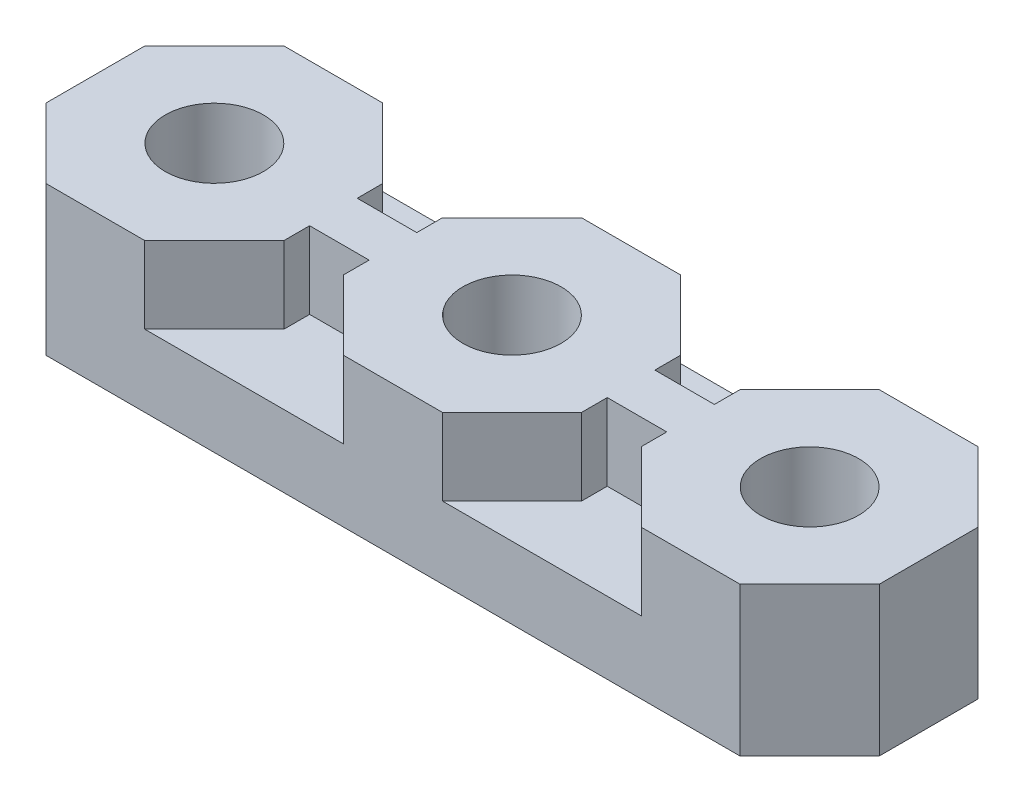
ISO-10303-21;
HEADER;
FILE_DESCRIPTION(('STEP AP214'),'2;1');
FILE_NAME('part.step','',(''),(''),'','','');
FILE_SCHEMA(('AUTOMOTIVE_DESIGN { 1 0 10303 214 1 1 1 1 }'));
ENDSEC;
DATA;
#1=APPLICATION_CONTEXT('core data for automotive mechanical design processes');
#2=APPLICATION_PROTOCOL_DEFINITION('international standard','automotive_design',2000,#1);
#3=PRODUCT_CONTEXT('',#1,'mechanical');
#4=PRODUCT('Part','Part','',(#3));
#5=PRODUCT_RELATED_PRODUCT_CATEGORY('part','',(#4));
#6=PRODUCT_DEFINITION_FORMATION('','',#4);
#7=PRODUCT_DEFINITION_CONTEXT('part definition',#1,'design');
#8=PRODUCT_DEFINITION('design','',#6,#7);
#9=PRODUCT_DEFINITION_SHAPE('','',#8);
#10=(LENGTH_UNIT() NAMED_UNIT(*) SI_UNIT(.MILLI.,.METRE.));
#11=(NAMED_UNIT(*) PLANE_ANGLE_UNIT() SI_UNIT($,.RADIAN.));
#12=(NAMED_UNIT(*) SI_UNIT($,.STERADIAN.) SOLID_ANGLE_UNIT());
#13=UNCERTAINTY_MEASURE_WITH_UNIT(LENGTH_MEASURE(1.E-05),#10,'distance_accuracy_value','');
#14=(GEOMETRIC_REPRESENTATION_CONTEXT(3) GLOBAL_UNCERTAINTY_ASSIGNED_CONTEXT((#13)) GLOBAL_UNIT_ASSIGNED_CONTEXT((#10,
#11,#12)) REPRESENTATION_CONTEXT('',''));
#15=CARTESIAN_POINT('',(0.,0.,0.));
#16=DIRECTION('',(0.,0.,1.));
#17=DIRECTION('',(1.,0.,0.));
#18=AXIS2_PLACEMENT_3D('',#15,#16,#17);
#19=CARTESIAN_POINT('',(0.,0.,0.));
#20=DIRECTION('',(0.,-1.,0.));
#21=DIRECTION('',(0.,0.,-1.));
#22=AXIS2_PLACEMENT_3D('',#19,#20,#21);
#23=PLANE('',#22);
#24=DIRECTION('',(0.,0.,1.));
#25=VECTOR('',#24,1.);
#26=CARTESIAN_POINT('',(-2.23593242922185,0.,0.));
#27=LINE('',#26,#25);
#28=CARTESIAN_POINT('',(-2.23593242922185,0.,-3.556));
#29=VERTEX_POINT('',#28);
#30=CARTESIAN_POINT('',(-2.23593242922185,0.,3.556));
#31=VERTEX_POINT('',#30);
#32=EDGE_CURVE('E58',#29,#31,#27,.T.);
#33=ORIENTED_EDGE('',*,*,#32,.F.);
#34=DIRECTION('',(1.,0.,0.));
#35=VECTOR('',#34,1.);
#36=CARTESIAN_POINT('',(0.,0.,-3.556));
#37=LINE('',#36,#35);
#38=CARTESIAN_POINT('',(-10.3639324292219,0.,-3.556));
#39=VERTEX_POINT('',#38);
#40=EDGE_CURVE('E334',#39,#29,#37,.T.);
#41=ORIENTED_EDGE('',*,*,#40,.F.);
#42=DIRECTION('',(0.,0.,1.));
#43=VECTOR('',#42,1.);
#44=CARTESIAN_POINT('',(-10.3639324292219,0.,0.));
#45=LINE('',#44,#43);
#46=CARTESIAN_POINT('',(-10.3639324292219,0.,3.556));
#47=VERTEX_POINT('',#46);
#48=EDGE_CURVE('E346',#39,#47,#45,.T.);
#49=ORIENTED_EDGE('',*,*,#48,.T.);
#50=DIRECTION('',(1.,0.,0.));
#51=VECTOR('',#50,1.);
#52=CARTESIAN_POINT('',(0.,0.,3.556));
#53=LINE('',#52,#51);
#54=EDGE_CURVE('E343',#47,#31,#53,.T.);
#55=ORIENTED_EDGE('',*,*,#54,.T.);
#56=EDGE_LOOP('',(#33,#41,#49,#55));
#57=FACE_BOUND('',#56,.T.);
#58=CARTESIAN_POINT('',(0.,0.,0.));
#59=DIRECTION('',(0.,1.,0.));
#60=DIRECTION('',(0.,0.,1.));
#61=AXIS2_PLACEMENT_3D('',#58,#59,#60);
#62=CIRCLE('',#61,2.0955);
#63=CARTESIAN_POINT('',(0.,0.,2.0955));
#64=VERTEX_POINT('',#63);
#65=EDGE_CURVE('E576',#64,#64,#62,.T.);
#66=ORIENTED_EDGE('',*,*,#65,.T.);
#67=EDGE_LOOP('',(#66));
#68=FACE_BOUND('',#67,.T.);
#69=CARTESIAN_POINT('',(12.7,0.,0.));
#70=DIRECTION('',(0.,1.,0.));
#71=DIRECTION('',(0.,0.,1.));
#72=AXIS2_PLACEMENT_3D('',#69,#70,#71);
#73=CIRCLE('',#72,2.0955);
#74=CARTESIAN_POINT('',(12.7,0.,2.0955));
#75=VERTEX_POINT('',#74);
#76=EDGE_CURVE('E583',#75,#75,#73,.T.);
#77=ORIENTED_EDGE('',*,*,#76,.T.);
#78=EDGE_LOOP('',(#77));
#79=FACE_BOUND('',#78,.T.);
#80=CARTESIAN_POINT('',(-12.7,0.,0.));
#81=DIRECTION('',(0.,1.,0.));
#82=DIRECTION('',(0.,0.,1.));
#83=AXIS2_PLACEMENT_3D('',#80,#81,#82);
#84=CIRCLE('',#83,2.0955);
#85=CARTESIAN_POINT('',(-12.7,0.,2.0955));
#86=VERTEX_POINT('',#85);
#87=EDGE_CURVE('E588',#86,#86,#84,.T.);
#88=ORIENTED_EDGE('',*,*,#87,.T.);
#89=EDGE_LOOP('',(#88));
#90=FACE_BOUND('',#89,.T.);
#91=DIRECTION('',(1.,0.,0.));
#92=VECTOR('',#91,1.);
#93=CARTESIAN_POINT('',(17.78,0.,5.08));
#94=LINE('',#93,#92);
#95=CARTESIAN_POINT('',(-14.8042048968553,0.,5.08000000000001));
#96=VERTEX_POINT('',#95);
#97=CARTESIAN_POINT('',(14.8042048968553,0.,5.08));
#98=VERTEX_POINT('',#97);
#99=EDGE_CURVE('E606',#96,#98,#94,.T.);
#100=ORIENTED_EDGE('',*,*,#99,.F.);
#101=DIRECTION('',(0.707106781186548,0.,0.707106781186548));
#102=VECTOR('',#101,1.);
#103=CARTESIAN_POINT('',(-9.94210244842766,0.,9.94210244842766));
#104=LINE('',#103,#102);
#105=CARTESIAN_POINT('',(-17.78,0.,2.10420489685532));
#106=VERTEX_POINT('',#105);
#107=EDGE_CURVE('E359',#106,#96,#104,.T.);
#108=ORIENTED_EDGE('',*,*,#107,.F.);
#109=DIRECTION('',(0.,0.,1.));
#110=VECTOR('',#109,1.);
#111=CARTESIAN_POINT('',(-17.78,0.,-5.07999999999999));
#112=LINE('',#111,#110);
#113=CARTESIAN_POINT('',(-17.78,0.,-2.10420489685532));
#114=VERTEX_POINT('',#113);
#115=EDGE_CURVE('E591',#114,#106,#112,.T.);
#116=ORIENTED_EDGE('',*,*,#115,.F.);
#117=DIRECTION('',(-0.707106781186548,0.,0.707106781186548));
#118=VECTOR('',#117,1.);
#119=CARTESIAN_POINT('',(-9.94210244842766,0.,-9.94210244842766));
#120=LINE('',#119,#118);
#121=CARTESIAN_POINT('',(-14.8042048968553,0.,-5.07999999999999));
#122=VERTEX_POINT('',#121);
#123=EDGE_CURVE('E389',#122,#114,#120,.T.);
#124=ORIENTED_EDGE('',*,*,#123,.F.);
#125=DIRECTION('',(-1.,0.,0.));
#126=VECTOR('',#125,1.);
#127=CARTESIAN_POINT('',(17.78,0.,-5.08));
#128=LINE('',#127,#126);
#129=CARTESIAN_POINT('',(14.8042048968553,0.,-5.08));
#130=VERTEX_POINT('',#129);
#131=EDGE_CURVE('E36',#130,#122,#128,.T.);
#132=ORIENTED_EDGE('',*,*,#131,.F.);
#133=DIRECTION('',(0.707106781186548,0.,0.707106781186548));
#134=VECTOR('',#133,1.);
#135=CARTESIAN_POINT('',(9.94210244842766,0.,-9.94210244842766));
#136=LINE('',#135,#134);
#137=CARTESIAN_POINT('',(17.78,0.,-2.10420489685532));
#138=VERTEX_POINT('',#137);
#139=EDGE_CURVE('E381',#130,#138,#136,.T.);
#140=ORIENTED_EDGE('',*,*,#139,.T.);
#141=DIRECTION('',(0.,0.,-1.));
#142=VECTOR('',#141,1.);
#143=CARTESIAN_POINT('',(17.78,0.,-5.08));
#144=LINE('',#143,#142);
#145=CARTESIAN_POINT('',(17.78,0.,2.10420489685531));
#146=VERTEX_POINT('',#145);
#147=EDGE_CURVE('E608',#146,#138,#144,.T.);
#148=ORIENTED_EDGE('',*,*,#147,.F.);
#149=DIRECTION('',(-0.707106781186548,0.,0.707106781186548));
#150=VECTOR('',#149,1.);
#151=CARTESIAN_POINT('',(9.94210244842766,0.,9.94210244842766));
#152=LINE('',#151,#150);
#153=EDGE_CURVE('E371',#146,#98,#152,.T.);
#154=ORIENTED_EDGE('',*,*,#153,.T.);
#155=EDGE_LOOP('',(#100,#108,#116,#124,#132,#140,#148,#154));
#156=FACE_BOUND('',#155,.T.);
#157=DIRECTION('',(-1.,0.,0.));
#158=VECTOR('',#157,1.);
#159=CARTESIAN_POINT('',(0.,0.,-3.556));
#160=LINE('',#159,#158);
#161=CARTESIAN_POINT('',(10.3639324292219,0.,-3.556));
#162=VERTEX_POINT('',#161);
#163=CARTESIAN_POINT('',(2.23593242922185,0.,-3.556));
#164=VERTEX_POINT('',#163);
#165=EDGE_CURVE('E321',#162,#164,#160,.T.);
#166=ORIENTED_EDGE('',*,*,#165,.T.);
#167=DIRECTION('',(0.,0.,1.));
#168=VECTOR('',#167,1.);
#169=CARTESIAN_POINT('',(2.23593242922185,0.,0.));
#170=LINE('',#169,#168);
#171=CARTESIAN_POINT('',(2.23593242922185,0.,3.556));
#172=VERTEX_POINT('',#171);
#173=EDGE_CURVE('E50',#164,#172,#170,.T.);
#174=ORIENTED_EDGE('',*,*,#173,.T.);
#175=DIRECTION('',(-1.,0.,0.));
#176=VECTOR('',#175,1.);
#177=CARTESIAN_POINT('',(0.,0.,3.556));
#178=LINE('',#177,#176);
#179=CARTESIAN_POINT('',(10.3639324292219,0.,3.556));
#180=VERTEX_POINT('',#179);
#181=EDGE_CURVE('E312',#180,#172,#178,.T.);
#182=ORIENTED_EDGE('',*,*,#181,.F.);
#183=DIRECTION('',(0.,0.,1.));
#184=VECTOR('',#183,1.);
#185=CARTESIAN_POINT('',(10.3639324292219,0.,0.));
#186=LINE('',#185,#184);
#187=EDGE_CURVE('E315',#162,#180,#186,.T.);
#188=ORIENTED_EDGE('',*,*,#187,.F.);
#189=EDGE_LOOP('',(#166,#174,#182,#188));
#190=FACE_BOUND('',#189,.T.);
#191=ADVANCED_FACE('F32',(#57,#68,#79,#90,#156,#190),#23,.T.);
#192=CARTESIAN_POINT('',(0.,6.35,0.));
#193=DIRECTION('',(0.,-1.,0.));
#194=DIRECTION('',(0.,0.,-1.));
#195=AXIS2_PLACEMENT_3D('',#192,#193,#194);
#196=PLANE('',#195);
#197=CARTESIAN_POINT('',(-12.7,6.35,0.));
#198=DIRECTION('',(0.,1.,0.));
#199=DIRECTION('',(0.,0.,1.));
#200=AXIS2_PLACEMENT_3D('',#197,#198,#199);
#201=CIRCLE('',#200,2.0955);
#202=CARTESIAN_POINT('',(-12.7,6.35,2.0955));
#203=VERTEX_POINT('',#202);
#204=EDGE_CURVE('E579',#203,#203,#201,.T.);
#205=ORIENTED_EDGE('',*,*,#204,.F.);
#206=EDGE_LOOP('',(#205));
#207=FACE_BOUND('',#206,.T.);
#208=CARTESIAN_POINT('',(12.7,6.35,0.));
#209=DIRECTION('',(0.,1.,0.));
#210=DIRECTION('',(0.,0.,1.));
#211=AXIS2_PLACEMENT_3D('',#208,#209,#210);
#212=CIRCLE('',#211,2.0955);
#213=CARTESIAN_POINT('',(12.7,6.35,2.0955));
#214=VERTEX_POINT('',#213);
#215=EDGE_CURVE('E564',#214,#214,#212,.T.);
#216=ORIENTED_EDGE('',*,*,#215,.F.);
#217=EDGE_LOOP('',(#216));
#218=FACE_BOUND('',#217,.T.);
#219=CARTESIAN_POINT('',(0.,6.35,0.));
#220=DIRECTION('',(0.,1.,0.));
#221=DIRECTION('',(0.,0.,1.));
#222=AXIS2_PLACEMENT_3D('',#219,#220,#221);
#223=CIRCLE('',#222,2.0955);
#224=CARTESIAN_POINT('',(0.,6.35,2.0955));
#225=VERTEX_POINT('',#224);
#226=EDGE_CURVE('E580',#225,#225,#223,.T.);
#227=ORIENTED_EDGE('',*,*,#226,.F.);
#228=EDGE_LOOP('',(#227));
#229=FACE_BOUND('',#228,.T.);
#230=DIRECTION('',(0.707106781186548,0.,0.707106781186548));
#231=VECTOR('',#230,1.);
#232=CARTESIAN_POINT('',(-9.94210244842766,6.35,9.94210244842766));
#233=LINE('',#232,#231);
#234=CARTESIAN_POINT('',(-17.78,6.35,2.10420489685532));
#235=VERTEX_POINT('',#234);
#236=CARTESIAN_POINT('',(-14.8042048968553,6.35,5.08000000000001));
#237=VERTEX_POINT('',#236);
#238=EDGE_CURVE('E362',#235,#237,#233,.T.);
#239=ORIENTED_EDGE('',*,*,#238,.T.);
#240=DIRECTION('',(1.,0.,0.));
#241=VECTOR('',#240,1.);
#242=CARTESIAN_POINT('',(17.78,6.35,5.08));
#243=LINE('',#242,#241);
#244=CARTESIAN_POINT('',(-10.5957951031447,6.35,5.08000000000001));
#245=VERTEX_POINT('',#244);
#246=EDGE_CURVE('E598',#237,#245,#243,.T.);
#247=ORIENTED_EDGE('',*,*,#246,.T.);
#248=DIRECTION('',(0.707106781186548,0.,-0.707106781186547));
#249=VECTOR('',#248,1.);
#250=CARTESIAN_POINT('',(-2.75789755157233,6.35,-2.75789755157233));
#251=LINE('',#250,#249);
#252=CARTESIAN_POINT('',(-7.61999999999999,6.35,2.10420489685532));
#253=VERTEX_POINT('',#252);
#254=EDGE_CURVE('E426',#245,#253,#251,.T.);
#255=ORIENTED_EDGE('',*,*,#254,.T.);
#256=DIRECTION('',(0.,0.,-1.));
#257=VECTOR('',#256,1.);
#258=CARTESIAN_POINT('',(-7.61999999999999,6.35,0.));
#259=LINE('',#258,#257);
#260=CARTESIAN_POINT('',(-7.61999999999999,6.35,1.016));
#261=VERTEX_POINT('',#260);
#262=EDGE_CURVE('E423',#253,#261,#259,.T.);
#263=ORIENTED_EDGE('',*,*,#262,.T.);
#264=DIRECTION('',(-1.,0.,0.));
#265=VECTOR('',#264,1.);
#266=CARTESIAN_POINT('',(0.,6.35,1.016));
#267=LINE('',#266,#265);
#268=CARTESIAN_POINT('',(-5.08,6.35,1.016));
#269=VERTEX_POINT('',#268);
#270=EDGE_CURVE('E419',#269,#261,#267,.T.);
#271=ORIENTED_EDGE('',*,*,#270,.F.);
#272=DIRECTION('',(0.,0.,1.));
#273=VECTOR('',#272,1.);
#274=CARTESIAN_POINT('',(-5.08,6.35,0.));
#275=LINE('',#274,#273);
#276=CARTESIAN_POINT('',(-5.08,6.35,2.10420489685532));
#277=VERTEX_POINT('',#276);
#278=EDGE_CURVE('E416',#269,#277,#275,.T.);
#279=ORIENTED_EDGE('',*,*,#278,.T.);
#280=DIRECTION('',(0.707106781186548,0.,0.707106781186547));
#281=VECTOR('',#280,1.);
#282=CARTESIAN_POINT('',(-3.59210244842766,6.35,3.59210244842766));
#283=LINE('',#282,#281);
#284=CARTESIAN_POINT('',(-2.10420489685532,6.35,5.08));
#285=VERTEX_POINT('',#284);
#286=EDGE_CURVE('E403',#277,#285,#283,.T.);
#287=ORIENTED_EDGE('',*,*,#286,.T.);
#288=CARTESIAN_POINT('',(2.10420489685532,6.35,5.08));
#289=VERTEX_POINT('',#288);
#290=EDGE_CURVE('E601',#285,#289,#243,.T.);
#291=ORIENTED_EDGE('',*,*,#290,.T.);
#292=DIRECTION('',(0.707106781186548,0.,-0.707106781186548));
#293=VECTOR('',#292,1.);
#294=CARTESIAN_POINT('',(3.59210244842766,6.35,3.59210244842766));
#295=LINE('',#294,#293);
#296=CARTESIAN_POINT('',(5.08,6.35,2.10420489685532));
#297=VERTEX_POINT('',#296);
#298=EDGE_CURVE('E472',#289,#297,#295,.T.);
#299=ORIENTED_EDGE('',*,*,#298,.T.);
#300=DIRECTION('',(0.,0.,-1.));
#301=VECTOR('',#300,1.);
#302=CARTESIAN_POINT('',(5.08,6.35,0.));
#303=LINE('',#302,#301);
#304=CARTESIAN_POINT('',(5.08,6.35,1.016));
#305=VERTEX_POINT('',#304);
#306=EDGE_CURVE('E469',#297,#305,#303,.T.);
#307=ORIENTED_EDGE('',*,*,#306,.T.);
#308=DIRECTION('',(-1.,0.,0.));
#309=VECTOR('',#308,1.);
#310=CARTESIAN_POINT('',(0.,6.35,1.016));
#311=LINE('',#310,#309);
#312=CARTESIAN_POINT('',(7.61999999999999,6.35,1.016));
#313=VERTEX_POINT('',#312);
#314=EDGE_CURVE('E465',#313,#305,#311,.T.);
#315=ORIENTED_EDGE('',*,*,#314,.F.);
#316=DIRECTION('',(0.,0.,-1.));
#317=VECTOR('',#316,1.);
#318=CARTESIAN_POINT('',(7.61999999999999,6.35,0.));
#319=LINE('',#318,#317);
#320=CARTESIAN_POINT('',(7.61999999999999,6.35,2.10420489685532));
#321=VERTEX_POINT('',#320);
#322=EDGE_CURVE('E462',#321,#313,#319,.T.);
#323=ORIENTED_EDGE('',*,*,#322,.F.);
#324=DIRECTION('',(-0.707106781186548,0.,-0.707106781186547));
#325=VECTOR('',#324,1.);
#326=CARTESIAN_POINT('',(2.75789755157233,6.35,-2.75789755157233));
#327=LINE('',#326,#325);
#328=CARTESIAN_POINT('',(10.5957951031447,6.35,5.08));
#329=VERTEX_POINT('',#328);
#330=EDGE_CURVE('E449',#329,#321,#327,.T.);
#331=ORIENTED_EDGE('',*,*,#330,.F.);
#332=CARTESIAN_POINT('',(14.8042048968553,6.35,5.08));
#333=VERTEX_POINT('',#332);
#334=EDGE_CURVE('E597',#329,#333,#243,.T.);
#335=ORIENTED_EDGE('',*,*,#334,.T.);
#336=DIRECTION('',(-0.707106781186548,0.,0.707106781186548));
#337=VECTOR('',#336,1.);
#338=CARTESIAN_POINT('',(9.94210244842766,6.35,9.94210244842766));
#339=LINE('',#338,#337);
#340=CARTESIAN_POINT('',(17.78,6.35,2.10420489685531));
#341=VERTEX_POINT('',#340);
#342=EDGE_CURVE('E375',#341,#333,#339,.T.);
#343=ORIENTED_EDGE('',*,*,#342,.F.);
#344=DIRECTION('',(0.,0.,-1.));
#345=VECTOR('',#344,1.);
#346=CARTESIAN_POINT('',(17.78,6.35,-5.08));
#347=LINE('',#346,#345);
#348=CARTESIAN_POINT('',(17.78,6.35,-2.10420489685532));
#349=VERTEX_POINT('',#348);
#350=EDGE_CURVE('E600',#341,#349,#347,.T.);
#351=ORIENTED_EDGE('',*,*,#350,.T.);
#352=DIRECTION('',(0.707106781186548,0.,0.707106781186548));
#353=VECTOR('',#352,1.);
#354=CARTESIAN_POINT('',(9.94210244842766,6.35,-9.94210244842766));
#355=LINE('',#354,#353);
#356=CARTESIAN_POINT('',(14.8042048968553,6.35,-5.08));
#357=VERTEX_POINT('',#356);
#358=EDGE_CURVE('E353',#357,#349,#355,.T.);
#359=ORIENTED_EDGE('',*,*,#358,.F.);
#360=DIRECTION('',(-1.,0.,0.));
#361=VECTOR('',#360,1.);
#362=CARTESIAN_POINT('',(17.78,6.35,-5.08));
#363=LINE('',#362,#361);
#364=CARTESIAN_POINT('',(10.5957951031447,6.35,-5.08));
#365=VERTEX_POINT('',#364);
#366=EDGE_CURVE('E11',#357,#365,#363,.T.);
#367=ORIENTED_EDGE('',*,*,#366,.T.);
#368=DIRECTION('',(0.707106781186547,0.,-0.707106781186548));
#369=VECTOR('',#368,1.);
#370=CARTESIAN_POINT('',(2.75789755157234,6.35,2.75789755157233));
#371=LINE('',#370,#369);
#372=CARTESIAN_POINT('',(7.61999999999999,6.35,-2.10420489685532));
#373=VERTEX_POINT('',#372);
#374=EDGE_CURVE('E511',#373,#365,#371,.T.);
#375=ORIENTED_EDGE('',*,*,#374,.F.);
#376=DIRECTION('',(0.,0.,-1.));
#377=VECTOR('',#376,1.);
#378=CARTESIAN_POINT('',(7.61999999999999,6.35,0.));
#379=LINE('',#378,#377);
#380=CARTESIAN_POINT('',(7.61999999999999,6.35,-1.016));
#381=VERTEX_POINT('',#380);
#382=EDGE_CURVE('E508',#381,#373,#379,.T.);
#383=ORIENTED_EDGE('',*,*,#382,.F.);
#384=DIRECTION('',(-1.,0.,0.));
#385=VECTOR('',#384,1.);
#386=CARTESIAN_POINT('',(0.,6.35,-1.016));
#387=LINE('',#386,#385);
#388=CARTESIAN_POINT('',(5.08,6.35,-1.016));
#389=VERTEX_POINT('',#388);
#390=EDGE_CURVE('E396',#381,#389,#387,.T.);
#391=ORIENTED_EDGE('',*,*,#390,.T.);
#392=DIRECTION('',(0.,0.,-1.));
#393=VECTOR('',#392,1.);
#394=CARTESIAN_POINT('',(5.08,6.35,0.));
#395=LINE('',#394,#393);
#396=CARTESIAN_POINT('',(5.08,6.35,-2.10420489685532));
#397=VERTEX_POINT('',#396);
#398=EDGE_CURVE('E492',#389,#397,#395,.T.);
#399=ORIENTED_EDGE('',*,*,#398,.T.);
#400=DIRECTION('',(-0.707106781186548,0.,-0.707106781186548));
#401=VECTOR('',#400,1.);
#402=CARTESIAN_POINT('',(3.59210244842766,6.35,-3.59210244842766));
#403=LINE('',#402,#401);
#404=CARTESIAN_POINT('',(2.10420489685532,6.35,-5.08));
#405=VERTEX_POINT('',#404);
#406=EDGE_CURVE('E514',#397,#405,#403,.T.);
#407=ORIENTED_EDGE('',*,*,#406,.T.);
#408=CARTESIAN_POINT('',(-2.10420489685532,6.35,-5.08));
#409=VERTEX_POINT('',#408);
#410=EDGE_CURVE('E41',#405,#409,#363,.T.);
#411=ORIENTED_EDGE('',*,*,#410,.T.);
#412=DIRECTION('',(-0.707106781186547,0.,0.707106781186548));
#413=VECTOR('',#412,1.);
#414=CARTESIAN_POINT('',(-3.59210244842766,6.35,-3.59210244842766));
#415=LINE('',#414,#413);
#416=CARTESIAN_POINT('',(-5.08,6.35,-2.10420489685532));
#417=VERTEX_POINT('',#416);
#418=EDGE_CURVE('E553',#409,#417,#415,.T.);
#419=ORIENTED_EDGE('',*,*,#418,.T.);
#420=DIRECTION('',(0.,0.,1.));
#421=VECTOR('',#420,1.);
#422=CARTESIAN_POINT('',(-5.08,6.35,0.));
#423=LINE('',#422,#421);
#424=CARTESIAN_POINT('',(-5.08,6.35,-1.016));
#425=VERTEX_POINT('',#424);
#426=EDGE_CURVE('E550',#417,#425,#423,.T.);
#427=ORIENTED_EDGE('',*,*,#426,.T.);
#428=DIRECTION('',(-1.,0.,0.));
#429=VECTOR('',#428,1.);
#430=CARTESIAN_POINT('',(0.,6.35,-1.016));
#431=LINE('',#430,#429);
#432=CARTESIAN_POINT('',(-7.61999999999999,6.35,-1.016));
#433=VERTEX_POINT('',#432);
#434=EDGE_CURVE('E434',#425,#433,#431,.T.);
#435=ORIENTED_EDGE('',*,*,#434,.T.);
#436=DIRECTION('',(0.,0.,-1.));
#437=VECTOR('',#436,1.);
#438=CARTESIAN_POINT('',(-7.61999999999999,6.35,0.));
#439=LINE('',#438,#437);
#440=CARTESIAN_POINT('',(-7.61999999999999,6.35,-2.10420489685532));
#441=VERTEX_POINT('',#440);
#442=EDGE_CURVE('E536',#433,#441,#439,.T.);
#443=ORIENTED_EDGE('',*,*,#442,.T.);
#444=DIRECTION('',(-0.707106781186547,0.,-0.707106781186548));
#445=VECTOR('',#444,1.);
#446=CARTESIAN_POINT('',(-2.75789755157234,6.35,2.75789755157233));
#447=LINE('',#446,#445);
#448=CARTESIAN_POINT('',(-10.5957951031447,6.35,-5.08));
#449=VERTEX_POINT('',#448);
#450=EDGE_CURVE('E556',#441,#449,#447,.T.);
#451=ORIENTED_EDGE('',*,*,#450,.T.);
#452=CARTESIAN_POINT('',(-14.8042048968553,6.35,-5.07999999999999));
#453=VERTEX_POINT('',#452);
#454=EDGE_CURVE('E43',#449,#453,#363,.T.);
#455=ORIENTED_EDGE('',*,*,#454,.T.);
#456=DIRECTION('',(-0.707106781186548,0.,0.707106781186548));
#457=VECTOR('',#456,1.);
#458=CARTESIAN_POINT('',(-9.94210244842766,6.35,-9.94210244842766));
#459=LINE('',#458,#457);
#460=CARTESIAN_POINT('',(-17.78,6.35,-2.10420489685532));
#461=VERTEX_POINT('',#460);
#462=EDGE_CURVE('E368',#453,#461,#459,.T.);
#463=ORIENTED_EDGE('',*,*,#462,.T.);
#464=DIRECTION('',(0.,0.,1.));
#465=VECTOR('',#464,1.);
#466=CARTESIAN_POINT('',(-17.78,6.35,-5.07999999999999));
#467=LINE('',#466,#465);
#468=EDGE_CURVE('E594',#461,#235,#467,.T.);
#469=ORIENTED_EDGE('',*,*,#468,.T.);
#470=EDGE_LOOP('',(#239,#247,#255,#263,#271,#279,#287,#291,#299,#307,#315,#323,#331,#335,#343,
#351,#359,#367,#375,#383,#391,#399,#407,#411,#419,#427,#435,#443,#451,#455,#463,#469));
#471=FACE_BOUND('',#470,.T.);
#472=ADVANCED_FACE('F633',(#207,#218,#229,#471),#196,.F.);
#473=CARTESIAN_POINT('',(-17.78,6.35,-5.07999999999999));
#474=DIRECTION('',(1.,0.,0.));
#475=DIRECTION('',(0.,0.,-1.));
#476=AXIS2_PLACEMENT_3D('',#473,#474,#475);
#477=PLANE('',#476);
#478=DIRECTION('',(0.,1.,0.));
#479=VECTOR('',#478,1.);
#480=CARTESIAN_POINT('',(-17.78,0.,2.10420489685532));
#481=LINE('',#480,#479);
#482=EDGE_CURVE('E361',#106,#235,#481,.T.);
#483=ORIENTED_EDGE('',*,*,#482,.T.);
#484=ORIENTED_EDGE('',*,*,#468,.F.);
#485=DIRECTION('',(0.,1.,0.));
#486=VECTOR('',#485,1.);
#487=CARTESIAN_POINT('',(-17.78,0.,-2.10420489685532));
#488=LINE('',#487,#486);
#489=EDGE_CURVE('E394',#114,#461,#488,.T.);
#490=ORIENTED_EDGE('',*,*,#489,.F.);
#491=ORIENTED_EDGE('',*,*,#115,.T.);
#492=EDGE_LOOP('',(#483,#484,#490,#491));
#493=FACE_BOUND('',#492,.T.);
#494=ADVANCED_FACE('F34',(#493),#477,.F.);
#495=CARTESIAN_POINT('',(17.78,6.35,5.08));
#496=DIRECTION('',(0.,0.,-1.));
#497=DIRECTION('',(-1.,0.,0.));
#498=AXIS2_PLACEMENT_3D('',#495,#496,#497);
#499=PLANE('',#498);
#500=DIRECTION('',(0.,1.,0.));
#501=VECTOR('',#500,1.);
#502=CARTESIAN_POINT('',(-14.8042048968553,0.,5.08000000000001));
#503=LINE('',#502,#501);
#504=EDGE_CURVE('E366',#96,#237,#503,.T.);
#505=ORIENTED_EDGE('',*,*,#504,.F.);
#506=ORIENTED_EDGE('',*,*,#99,.T.);
#507=DIRECTION('',(0.,1.,0.));
#508=VECTOR('',#507,1.);
#509=CARTESIAN_POINT('',(14.8042048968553,0.,5.08));
#510=LINE('',#509,#508);
#511=EDGE_CURVE('E365',#98,#333,#510,.T.);
#512=ORIENTED_EDGE('',*,*,#511,.T.);
#513=ORIENTED_EDGE('',*,*,#334,.F.);
#514=DIRECTION('',(0.,1.,0.));
#515=VECTOR('',#514,1.);
#516=CARTESIAN_POINT('',(10.5957951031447,3.0734,5.08));
#517=LINE('',#516,#515);
#518=CARTESIAN_POINT('',(10.5957951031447,3.0734,5.08));
#519=VERTEX_POINT('',#518);
#520=EDGE_CURVE('E478',#519,#329,#517,.T.);
#521=ORIENTED_EDGE('',*,*,#520,.F.);
#522=DIRECTION('',(1.,0.,0.));
#523=VECTOR('',#522,1.);
#524=CARTESIAN_POINT('',(0.,3.0734,5.08));
#525=LINE('',#524,#523);
#526=CARTESIAN_POINT('',(2.10420489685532,3.0734,5.08));
#527=VERTEX_POINT('',#526);
#528=EDGE_CURVE('E456',#527,#519,#525,.T.);
#529=ORIENTED_EDGE('',*,*,#528,.F.);
#530=DIRECTION('',(0.,1.,0.));
#531=VECTOR('',#530,1.);
#532=CARTESIAN_POINT('',(2.10420489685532,3.0734,5.08));
#533=LINE('',#532,#531);
#534=EDGE_CURVE('E480',#527,#289,#533,.T.);
#535=ORIENTED_EDGE('',*,*,#534,.T.);
#536=ORIENTED_EDGE('',*,*,#290,.F.);
#537=DIRECTION('',(0.,1.,0.));
#538=VECTOR('',#537,1.);
#539=CARTESIAN_POINT('',(-2.10420489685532,3.0734,5.08));
#540=LINE('',#539,#538);
#541=CARTESIAN_POINT('',(-2.10420489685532,3.0734,5.08));
#542=VERTEX_POINT('',#541);
#543=EDGE_CURVE('E435',#542,#285,#540,.T.);
#544=ORIENTED_EDGE('',*,*,#543,.F.);
#545=DIRECTION('',(1.,0.,0.));
#546=VECTOR('',#545,1.);
#547=CARTESIAN_POINT('',(0.,3.0734,5.08));
#548=LINE('',#547,#546);
#549=CARTESIAN_POINT('',(-10.5957951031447,3.0734,5.08));
#550=VERTEX_POINT('',#549);
#551=EDGE_CURVE('E410',#550,#542,#548,.T.);
#552=ORIENTED_EDGE('',*,*,#551,.F.);
#553=DIRECTION('',(0.,1.,0.));
#554=VECTOR('',#553,1.);
#555=CARTESIAN_POINT('',(-10.5957951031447,3.0734,5.08000000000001));
#556=LINE('',#555,#554);
#557=EDGE_CURVE('E437',#550,#245,#556,.T.);
#558=ORIENTED_EDGE('',*,*,#557,.T.);
#559=ORIENTED_EDGE('',*,*,#246,.F.);
#560=EDGE_LOOP('',(#505,#506,#512,#513,#521,#529,#535,#536,#544,#552,#558,#559));
#561=FACE_BOUND('',#560,.T.);
#562=ADVANCED_FACE('F684',(#561),#499,.F.);
#563=CARTESIAN_POINT('',(17.78,6.35,-5.08));
#564=DIRECTION('',(0.,0.,1.));
#565=DIRECTION('',(1.,0.,0.));
#566=AXIS2_PLACEMENT_3D('',#563,#564,#565);
#567=PLANE('',#566);
#568=ORIENTED_EDGE('',*,*,#366,.F.);
#569=DIRECTION('',(0.,1.,0.));
#570=VECTOR('',#569,1.);
#571=CARTESIAN_POINT('',(14.8042048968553,0.,-5.08));
#572=LINE('',#571,#570);
#573=EDGE_CURVE('E384',#130,#357,#572,.T.);
#574=ORIENTED_EDGE('',*,*,#573,.F.);
#575=ORIENTED_EDGE('',*,*,#131,.T.);
#576=DIRECTION('',(0.,1.,0.));
#577=VECTOR('',#576,1.);
#578=CARTESIAN_POINT('',(-14.8042048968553,0.,-5.07999999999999));
#579=LINE('',#578,#577);
#580=EDGE_CURVE('E391',#122,#453,#579,.T.);
#581=ORIENTED_EDGE('',*,*,#580,.T.);
#582=ORIENTED_EDGE('',*,*,#454,.F.);
#583=DIRECTION('',(0.,1.,0.));
#584=VECTOR('',#583,1.);
#585=CARTESIAN_POINT('',(-10.5957951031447,3.0734,-5.08));
#586=LINE('',#585,#584);
#587=CARTESIAN_POINT('',(-10.5957951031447,3.0734,-5.08));
#588=VERTEX_POINT('',#587);
#589=EDGE_CURVE('E567',#588,#449,#586,.T.);
#590=ORIENTED_EDGE('',*,*,#589,.F.);
#591=DIRECTION('',(-1.,0.,0.));
#592=VECTOR('',#591,1.);
#593=CARTESIAN_POINT('',(0.,3.0734,-5.08));
#594=LINE('',#593,#592);
#595=CARTESIAN_POINT('',(-2.10420489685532,3.0734,-5.08));
#596=VERTEX_POINT('',#595);
#597=EDGE_CURVE('E540',#596,#588,#594,.T.);
#598=ORIENTED_EDGE('',*,*,#597,.F.);
#599=DIRECTION('',(0.,1.,0.));
#600=VECTOR('',#599,1.);
#601=CARTESIAN_POINT('',(-2.10420489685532,3.0734,-5.08));
#602=LINE('',#601,#600);
#603=EDGE_CURVE('E569',#596,#409,#602,.T.);
#604=ORIENTED_EDGE('',*,*,#603,.T.);
#605=ORIENTED_EDGE('',*,*,#410,.F.);
#606=DIRECTION('',(0.,1.,0.));
#607=VECTOR('',#606,1.);
#608=CARTESIAN_POINT('',(2.10420489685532,3.0734,-5.08));
#609=LINE('',#608,#607);
#610=CARTESIAN_POINT('',(2.10420489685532,3.0734,-5.08));
#611=VERTEX_POINT('',#610);
#612=EDGE_CURVE('E523',#611,#405,#609,.T.);
#613=ORIENTED_EDGE('',*,*,#612,.F.);
#614=DIRECTION('',(-1.,0.,0.));
#615=VECTOR('',#614,1.);
#616=CARTESIAN_POINT('',(0.,3.0734,-5.08));
#617=LINE('',#616,#615);
#618=CARTESIAN_POINT('',(10.5957951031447,3.0734,-5.08));
#619=VERTEX_POINT('',#618);
#620=EDGE_CURVE('E498',#619,#611,#617,.T.);
#621=ORIENTED_EDGE('',*,*,#620,.F.);
#622=DIRECTION('',(0.,1.,0.));
#623=VECTOR('',#622,1.);
#624=CARTESIAN_POINT('',(10.5957951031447,3.0734,-5.08));
#625=LINE('',#624,#623);
#626=EDGE_CURVE('E525',#619,#365,#625,.T.);
#627=ORIENTED_EDGE('',*,*,#626,.T.);
#628=EDGE_LOOP('',(#568,#574,#575,#581,#582,#590,#598,#604,#605,#613,#621,#627));
#629=FACE_BOUND('',#628,.T.);
#630=ADVANCED_FACE('F618',(#629),#567,.F.);
#631=CARTESIAN_POINT('',(17.78,6.35,-5.08));
#632=DIRECTION('',(-1.,0.,0.));
#633=DIRECTION('',(0.,0.,1.));
#634=AXIS2_PLACEMENT_3D('',#631,#632,#633);
#635=PLANE('',#634);
#636=ORIENTED_EDGE('',*,*,#350,.F.);
#637=DIRECTION('',(0.,1.,0.));
#638=VECTOR('',#637,1.);
#639=CARTESIAN_POINT('',(17.78,0.,2.10420489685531));
#640=LINE('',#639,#638);
#641=EDGE_CURVE('E374',#146,#341,#640,.T.);
#642=ORIENTED_EDGE('',*,*,#641,.F.);
#643=ORIENTED_EDGE('',*,*,#147,.T.);
#644=DIRECTION('',(0.,1.,0.));
#645=VECTOR('',#644,1.);
#646=CARTESIAN_POINT('',(17.78,0.,-2.10420489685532));
#647=LINE('',#646,#645);
#648=EDGE_CURVE('E377',#138,#349,#647,.T.);
#649=ORIENTED_EDGE('',*,*,#648,.T.);
#650=EDGE_LOOP('',(#636,#642,#643,#649));
#651=FACE_BOUND('',#650,.T.);
#652=ADVANCED_FACE('F683',(#651),#635,.F.);
#653=CARTESIAN_POINT('',(-12.7,0.,0.));
#654=DIRECTION('',(0.,1.,0.));
#655=DIRECTION('',(0.,0.,1.));
#656=AXIS2_PLACEMENT_3D('',#653,#654,#655);
#657=CYLINDRICAL_SURFACE('',#656,2.0955);
#658=ORIENTED_EDGE('',*,*,#87,.F.);
#659=EDGE_LOOP('',(#658));
#660=FACE_BOUND('',#659,.T.);
#661=ORIENTED_EDGE('',*,*,#204,.T.);
#662=EDGE_LOOP('',(#661));
#663=FACE_BOUND('',#662,.T.);
#664=ADVANCED_FACE('F686',(#660,#663),#657,.F.);
#665=CARTESIAN_POINT('',(12.7,0.,0.));
#666=DIRECTION('',(0.,1.,0.));
#667=DIRECTION('',(0.,0.,1.));
#668=AXIS2_PLACEMENT_3D('',#665,#666,#667);
#669=CYLINDRICAL_SURFACE('',#668,2.0955);
#670=ORIENTED_EDGE('',*,*,#76,.F.);
#671=EDGE_LOOP('',(#670));
#672=FACE_BOUND('',#671,.T.);
#673=ORIENTED_EDGE('',*,*,#215,.T.);
#674=EDGE_LOOP('',(#673));
#675=FACE_BOUND('',#674,.T.);
#676=ADVANCED_FACE('F790',(#672,#675),#669,.F.);
#677=CARTESIAN_POINT('',(0.,0.,0.));
#678=DIRECTION('',(0.,1.,0.));
#679=DIRECTION('',(0.,0.,1.));
#680=AXIS2_PLACEMENT_3D('',#677,#678,#679);
#681=CYLINDRICAL_SURFACE('',#680,2.0955);
#682=ORIENTED_EDGE('',*,*,#65,.F.);
#683=EDGE_LOOP('',(#682));
#684=FACE_BOUND('',#683,.T.);
#685=ORIENTED_EDGE('',*,*,#226,.T.);
#686=EDGE_LOOP('',(#685));
#687=FACE_BOUND('',#686,.T.);
#688=ADVANCED_FACE('F787',(#684,#687),#681,.F.);
#689=CARTESIAN_POINT('',(0.,3.0734,-1.016));
#690=DIRECTION('',(0.,0.,-1.));
#691=DIRECTION('',(-1.,0.,0.));
#692=AXIS2_PLACEMENT_3D('',#689,#690,#691);
#693=PLANE('',#692);
#694=ORIENTED_EDGE('',*,*,#434,.F.);
#695=DIRECTION('',(0.,1.,0.));
#696=VECTOR('',#695,1.);
#697=CARTESIAN_POINT('',(-5.08,3.0734,-1.016));
#698=LINE('',#697,#696);
#699=CARTESIAN_POINT('',(-5.08,3.0734,-1.016));
#700=VERTEX_POINT('',#699);
#701=EDGE_CURVE('E547',#700,#425,#698,.T.);
#702=ORIENTED_EDGE('',*,*,#701,.F.);
#703=DIRECTION('',(-1.,0.,0.));
#704=VECTOR('',#703,1.);
#705=CARTESIAN_POINT('',(0.,3.0734,-1.016));
#706=LINE('',#705,#704);
#707=CARTESIAN_POINT('',(-7.61999999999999,3.0734,-1.016));
#708=VERTEX_POINT('',#707);
#709=EDGE_CURVE('E532',#700,#708,#706,.T.);
#710=ORIENTED_EDGE('',*,*,#709,.T.);
#711=DIRECTION('',(0.,1.,0.));
#712=VECTOR('',#711,1.);
#713=CARTESIAN_POINT('',(-7.61999999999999,3.0734,-1.016));
#714=LINE('',#713,#712);
#715=EDGE_CURVE('E561',#708,#433,#714,.T.);
#716=ORIENTED_EDGE('',*,*,#715,.T.);
#717=EDGE_LOOP('',(#694,#702,#710,#716));
#718=FACE_BOUND('',#717,.T.);
#719=ADVANCED_FACE('F655',(#718),#693,.T.);
#720=CARTESIAN_POINT('',(-7.61999999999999,3.0734,0.));
#721=DIRECTION('',(1.,0.,0.));
#722=DIRECTION('',(0.,0.,-1.));
#723=AXIS2_PLACEMENT_3D('',#720,#721,#722);
#724=PLANE('',#723);
#725=ORIENTED_EDGE('',*,*,#442,.F.);
#726=ORIENTED_EDGE('',*,*,#715,.F.);
#727=DIRECTION('',(0.,0.,-1.));
#728=VECTOR('',#727,1.);
#729=CARTESIAN_POINT('',(-7.61999999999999,3.0734,0.));
#730=LINE('',#729,#728);
#731=CARTESIAN_POINT('',(-7.61999999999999,3.0734,-2.10420489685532));
#732=VERTEX_POINT('',#731);
#733=EDGE_CURVE('E545',#708,#732,#730,.T.);
#734=ORIENTED_EDGE('',*,*,#733,.T.);
#735=DIRECTION('',(0.,1.,0.));
#736=VECTOR('',#735,1.);
#737=CARTESIAN_POINT('',(-7.61999999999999,3.0734,-2.10420489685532));
#738=LINE('',#737,#736);
#739=EDGE_CURVE('E565',#732,#441,#738,.T.);
#740=ORIENTED_EDGE('',*,*,#739,.T.);
#741=EDGE_LOOP('',(#725,#726,#734,#740));
#742=FACE_BOUND('',#741,.T.);
#743=ADVANCED_FACE('F658',(#742),#724,.T.);
#744=CARTESIAN_POINT('',(-2.75789755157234,3.0734,2.75789755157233));
#745=DIRECTION('',(0.707106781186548,0.,-0.707106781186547));
#746=DIRECTION('',(-0.707106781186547,0.,-0.707106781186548));
#747=AXIS2_PLACEMENT_3D('',#744,#745,#746);
#748=PLANE('',#747);
#749=ORIENTED_EDGE('',*,*,#450,.F.);
#750=ORIENTED_EDGE('',*,*,#739,.F.);
#751=DIRECTION('',(-0.707106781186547,0.,-0.707106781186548));
#752=VECTOR('',#751,1.);
#753=CARTESIAN_POINT('',(-2.75789755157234,3.0734,2.75789755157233));
#754=LINE('',#753,#752);
#755=EDGE_CURVE('E543',#732,#588,#754,.T.);
#756=ORIENTED_EDGE('',*,*,#755,.T.);
#757=ORIENTED_EDGE('',*,*,#589,.T.);
#758=EDGE_LOOP('',(#749,#750,#756,#757));
#759=FACE_BOUND('',#758,.T.);
#760=ADVANCED_FACE('F661',(#759),#748,.T.);
#761=CARTESIAN_POINT('',(-3.59210244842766,3.0734,-3.59210244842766));
#762=DIRECTION('',(-0.707106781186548,0.,-0.707106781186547));
#763=DIRECTION('',(-0.707106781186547,0.,0.707106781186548));
#764=AXIS2_PLACEMENT_3D('',#761,#762,#763);
#765=PLANE('',#764);
#766=ORIENTED_EDGE('',*,*,#418,.F.);
#767=ORIENTED_EDGE('',*,*,#603,.F.);
#768=DIRECTION('',(-0.707106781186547,0.,0.707106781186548));
#769=VECTOR('',#768,1.);
#770=CARTESIAN_POINT('',(-3.59210244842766,3.0734,-3.59210244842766));
#771=LINE('',#770,#769);
#772=CARTESIAN_POINT('',(-5.08,3.0734,-2.10420489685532));
#773=VERTEX_POINT('',#772);
#774=EDGE_CURVE('E538',#596,#773,#771,.T.);
#775=ORIENTED_EDGE('',*,*,#774,.T.);
#776=DIRECTION('',(0.,1.,0.));
#777=VECTOR('',#776,1.);
#778=CARTESIAN_POINT('',(-5.08,3.0734,-2.10420489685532));
#779=LINE('',#778,#777);
#780=EDGE_CURVE('E572',#773,#417,#779,.T.);
#781=ORIENTED_EDGE('',*,*,#780,.T.);
#782=EDGE_LOOP('',(#766,#767,#775,#781));
#783=FACE_BOUND('',#782,.T.);
#784=ADVANCED_FACE('F641',(#783),#765,.T.);
#785=CARTESIAN_POINT('',(-5.08,3.0734,0.));
#786=DIRECTION('',(-1.,0.,0.));
#787=DIRECTION('',(0.,0.,1.));
#788=AXIS2_PLACEMENT_3D('',#785,#786,#787);
#789=PLANE('',#788);
#790=ORIENTED_EDGE('',*,*,#426,.F.);
#791=ORIENTED_EDGE('',*,*,#780,.F.);
#792=DIRECTION('',(0.,0.,1.));
#793=VECTOR('',#792,1.);
#794=CARTESIAN_POINT('',(-5.08,3.0734,0.));
#795=LINE('',#794,#793);
#796=EDGE_CURVE('E535',#773,#700,#795,.T.);
#797=ORIENTED_EDGE('',*,*,#796,.T.);
#798=ORIENTED_EDGE('',*,*,#701,.T.);
#799=EDGE_LOOP('',(#790,#791,#797,#798));
#800=FACE_BOUND('',#799,.T.);
#801=ADVANCED_FACE('F652',(#800),#789,.T.);
#802=CARTESIAN_POINT('',(0.,3.0734,0.));
#803=DIRECTION('',(0.,1.,0.));
#804=DIRECTION('',(0.,0.,1.));
#805=AXIS2_PLACEMENT_3D('',#802,#803,#804);
#806=PLANE('',#805);
#807=ORIENTED_EDGE('',*,*,#709,.F.);
#808=ORIENTED_EDGE('',*,*,#796,.F.);
#809=ORIENTED_EDGE('',*,*,#774,.F.);
#810=ORIENTED_EDGE('',*,*,#597,.T.);
#811=ORIENTED_EDGE('',*,*,#755,.F.);
#812=ORIENTED_EDGE('',*,*,#733,.F.);
#813=EDGE_LOOP('',(#807,#808,#809,#810,#811,#812));
#814=FACE_BOUND('',#813,.T.);
#815=ADVANCED_FACE('F649',(#814),#806,.T.);
#816=CARTESIAN_POINT('',(7.61999999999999,3.0734,0.));
#817=DIRECTION('',(1.,0.,0.));
#818=DIRECTION('',(0.,0.,-1.));
#819=AXIS2_PLACEMENT_3D('',#816,#817,#818);
#820=PLANE('',#819);
#821=ORIENTED_EDGE('',*,*,#322,.T.);
#822=DIRECTION('',(0.,1.,0.));
#823=VECTOR('',#822,1.);
#824=CARTESIAN_POINT('',(7.61999999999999,3.0734,1.016));
#825=LINE('',#824,#823);
#826=CARTESIAN_POINT('',(7.61999999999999,3.0734,1.016));
#827=VERTEX_POINT('',#826);
#828=EDGE_CURVE('E461',#827,#313,#825,.T.);
#829=ORIENTED_EDGE('',*,*,#828,.F.);
#830=DIRECTION('',(0.,0.,-1.));
#831=VECTOR('',#830,1.);
#832=CARTESIAN_POINT('',(7.61999999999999,3.0734,0.));
#833=LINE('',#832,#831);
#834=CARTESIAN_POINT('',(7.61999999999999,3.0734,2.10420489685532));
#835=VERTEX_POINT('',#834);
#836=EDGE_CURVE('E445',#835,#827,#833,.T.);
#837=ORIENTED_EDGE('',*,*,#836,.F.);
#838=DIRECTION('',(0.,1.,0.));
#839=VECTOR('',#838,1.);
#840=CARTESIAN_POINT('',(7.61999999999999,3.0734,2.10420489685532));
#841=LINE('',#840,#839);
#842=EDGE_CURVE('E420',#835,#321,#841,.T.);
#843=ORIENTED_EDGE('',*,*,#842,.T.);
#844=EDGE_LOOP('',(#821,#829,#837,#843));
#845=FACE_BOUND('',#844,.T.);
#846=ADVANCED_FACE('F725',(#845),#820,.F.);
#847=CARTESIAN_POINT('',(2.75789755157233,3.0734,-2.75789755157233));
#848=DIRECTION('',(0.707106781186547,0.,-0.707106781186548));
#849=DIRECTION('',(-0.707106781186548,0.,-0.707106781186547));
#850=AXIS2_PLACEMENT_3D('',#847,#848,#849);
#851=PLANE('',#850);
#852=ORIENTED_EDGE('',*,*,#330,.T.);
#853=ORIENTED_EDGE('',*,*,#842,.F.);
#854=DIRECTION('',(-0.707106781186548,0.,-0.707106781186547));
#855=VECTOR('',#854,1.);
#856=CARTESIAN_POINT('',(2.75789755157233,3.0734,-2.75789755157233));
#857=LINE('',#856,#855);
#858=EDGE_CURVE('E458',#519,#835,#857,.T.);
#859=ORIENTED_EDGE('',*,*,#858,.F.);
#860=ORIENTED_EDGE('',*,*,#520,.T.);
#861=EDGE_LOOP('',(#852,#853,#859,#860));
#862=FACE_BOUND('',#861,.T.);
#863=ADVANCED_FACE('F728',(#862),#851,.F.);
#864=CARTESIAN_POINT('',(3.59210244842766,3.0734,3.59210244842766));
#865=DIRECTION('',(0.707106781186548,0.,0.707106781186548));
#866=DIRECTION('',(0.707106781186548,0.,-0.707106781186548));
#867=AXIS2_PLACEMENT_3D('',#864,#865,#866);
#868=PLANE('',#867);
#869=ORIENTED_EDGE('',*,*,#298,.F.);
#870=ORIENTED_EDGE('',*,*,#534,.F.);
#871=DIRECTION('',(0.707106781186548,0.,-0.707106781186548));
#872=VECTOR('',#871,1.);
#873=CARTESIAN_POINT('',(3.59210244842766,3.0734,3.59210244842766));
#874=LINE('',#873,#872);
#875=CARTESIAN_POINT('',(5.08,3.0734,2.10420489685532));
#876=VERTEX_POINT('',#875);
#877=EDGE_CURVE('E454',#527,#876,#874,.T.);
#878=ORIENTED_EDGE('',*,*,#877,.T.);
#879=DIRECTION('',(0.,1.,0.));
#880=VECTOR('',#879,1.);
#881=CARTESIAN_POINT('',(5.08,3.0734,2.10420489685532));
#882=LINE('',#881,#880);
#883=EDGE_CURVE('E483',#876,#297,#882,.T.);
#884=ORIENTED_EDGE('',*,*,#883,.T.);
#885=EDGE_LOOP('',(#869,#870,#878,#884));
#886=FACE_BOUND('',#885,.T.);
#887=ADVANCED_FACE('F711',(#886),#868,.T.);
#888=CARTESIAN_POINT('',(5.08,3.0734,0.));
#889=DIRECTION('',(1.,0.,0.));
#890=DIRECTION('',(0.,0.,-1.));
#891=AXIS2_PLACEMENT_3D('',#888,#889,#890);
#892=PLANE('',#891);
#893=ORIENTED_EDGE('',*,*,#306,.F.);
#894=ORIENTED_EDGE('',*,*,#883,.F.);
#895=DIRECTION('',(0.,0.,-1.));
#896=VECTOR('',#895,1.);
#897=CARTESIAN_POINT('',(5.08,3.0734,0.));
#898=LINE('',#897,#896);
#899=CARTESIAN_POINT('',(5.08,3.0734,1.016));
#900=VERTEX_POINT('',#899);
#901=EDGE_CURVE('E452',#876,#900,#898,.T.);
#902=ORIENTED_EDGE('',*,*,#901,.T.);
#903=DIRECTION('',(0.,1.,0.));
#904=VECTOR('',#903,1.);
#905=CARTESIAN_POINT('',(5.08,3.0734,1.016));
#906=LINE('',#905,#904);
#907=EDGE_CURVE('E485',#900,#305,#906,.T.);
#908=ORIENTED_EDGE('',*,*,#907,.T.);
#909=EDGE_LOOP('',(#893,#894,#902,#908));
#910=FACE_BOUND('',#909,.T.);
#911=ADVANCED_FACE('F716',(#910),#892,.T.);
#912=CARTESIAN_POINT('',(0.,3.0734,1.016));
#913=DIRECTION('',(0.,0.,-1.));
#914=DIRECTION('',(-1.,0.,0.));
#915=AXIS2_PLACEMENT_3D('',#912,#913,#914);
#916=PLANE('',#915);
#917=ORIENTED_EDGE('',*,*,#314,.T.);
#918=ORIENTED_EDGE('',*,*,#907,.F.);
#919=DIRECTION('',(-1.,0.,0.));
#920=VECTOR('',#919,1.);
#921=CARTESIAN_POINT('',(0.,3.0734,1.016));
#922=LINE('',#921,#920);
#923=EDGE_CURVE('E448',#827,#900,#922,.T.);
#924=ORIENTED_EDGE('',*,*,#923,.F.);
#925=ORIENTED_EDGE('',*,*,#828,.T.);
#926=EDGE_LOOP('',(#917,#918,#924,#925));
#927=FACE_BOUND('',#926,.T.);
#928=ADVANCED_FACE('F721',(#927),#916,.F.);
#929=CARTESIAN_POINT('',(0.,3.0734,0.));
#930=DIRECTION('',(0.,1.,0.));
#931=DIRECTION('',(0.,0.,1.));
#932=AXIS2_PLACEMENT_3D('',#929,#930,#931);
#933=PLANE('',#932);
#934=ORIENTED_EDGE('',*,*,#836,.T.);
#935=ORIENTED_EDGE('',*,*,#923,.T.);
#936=ORIENTED_EDGE('',*,*,#901,.F.);
#937=ORIENTED_EDGE('',*,*,#877,.F.);
#938=ORIENTED_EDGE('',*,*,#528,.T.);
#939=ORIENTED_EDGE('',*,*,#858,.T.);
#940=EDGE_LOOP('',(#934,#935,#936,#937,#938,#939));
#941=FACE_BOUND('',#940,.T.);
#942=ADVANCED_FACE('F730',(#941),#933,.T.);
#943=CARTESIAN_POINT('',(-5.08,3.0734,0.));
#944=DIRECTION('',(-1.,0.,0.));
#945=DIRECTION('',(0.,0.,1.));
#946=AXIS2_PLACEMENT_3D('',#943,#944,#945);
#947=PLANE('',#946);
#948=ORIENTED_EDGE('',*,*,#278,.F.);
#949=DIRECTION('',(0.,1.,0.));
#950=VECTOR('',#949,1.);
#951=CARTESIAN_POINT('',(-5.08,3.0734,1.016));
#952=LINE('',#951,#950);
#953=CARTESIAN_POINT('',(-5.08,3.0734,1.016));
#954=VERTEX_POINT('',#953);
#955=EDGE_CURVE('E415',#954,#269,#952,.T.);
#956=ORIENTED_EDGE('',*,*,#955,.F.);
#957=DIRECTION('',(0.,0.,1.));
#958=VECTOR('',#957,1.);
#959=CARTESIAN_POINT('',(-5.08,3.0734,0.));
#960=LINE('',#959,#958);
#961=CARTESIAN_POINT('',(-5.08,3.0734,2.10420489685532));
#962=VERTEX_POINT('',#961);
#963=EDGE_CURVE('E399',#954,#962,#960,.T.);
#964=ORIENTED_EDGE('',*,*,#963,.T.);
#965=DIRECTION('',(0.,1.,0.));
#966=VECTOR('',#965,1.);
#967=CARTESIAN_POINT('',(-5.08,3.0734,2.10420489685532));
#968=LINE('',#967,#966);
#969=EDGE_CURVE('E431',#962,#277,#968,.T.);
#970=ORIENTED_EDGE('',*,*,#969,.T.);
#971=EDGE_LOOP('',(#948,#956,#964,#970));
#972=FACE_BOUND('',#971,.T.);
#973=ADVANCED_FACE('F732',(#972),#947,.T.);
#974=CARTESIAN_POINT('',(-3.59210244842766,3.0734,3.59210244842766));
#975=DIRECTION('',(-0.707106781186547,0.,0.707106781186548));
#976=DIRECTION('',(0.707106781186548,0.,0.707106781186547));
#977=AXIS2_PLACEMENT_3D('',#974,#975,#976);
#978=PLANE('',#977);
#979=ORIENTED_EDGE('',*,*,#286,.F.);
#980=ORIENTED_EDGE('',*,*,#969,.F.);
#981=DIRECTION('',(0.707106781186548,0.,0.707106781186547));
#982=VECTOR('',#981,1.);
#983=CARTESIAN_POINT('',(-3.59210244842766,3.0734,3.59210244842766));
#984=LINE('',#983,#982);
#985=EDGE_CURVE('E413',#962,#542,#984,.T.);
#986=ORIENTED_EDGE('',*,*,#985,.T.);
#987=ORIENTED_EDGE('',*,*,#543,.T.);
#988=EDGE_LOOP('',(#979,#980,#986,#987));
#989=FACE_BOUND('',#988,.T.);
#990=ADVANCED_FACE('F738',(#989),#978,.T.);
#991=CARTESIAN_POINT('',(-2.75789755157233,3.0734,-2.75789755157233));
#992=DIRECTION('',(0.707106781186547,0.,0.707106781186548));
#993=DIRECTION('',(0.707106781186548,0.,-0.707106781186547));
#994=AXIS2_PLACEMENT_3D('',#991,#992,#993);
#995=PLANE('',#994);
#996=ORIENTED_EDGE('',*,*,#254,.F.);
#997=ORIENTED_EDGE('',*,*,#557,.F.);
#998=DIRECTION('',(0.707106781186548,0.,-0.707106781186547));
#999=VECTOR('',#998,1.);
#1000=CARTESIAN_POINT('',(-2.75789755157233,3.0734,-2.75789755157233));
#1001=LINE('',#1000,#999);
#1002=CARTESIAN_POINT('',(-7.61999999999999,3.0734,2.10420489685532));
#1003=VERTEX_POINT('',#1002);
#1004=EDGE_CURVE('E408',#550,#1003,#1001,.T.);
#1005=ORIENTED_EDGE('',*,*,#1004,.T.);
#1006=DIRECTION('',(0.,1.,0.));
#1007=VECTOR('',#1006,1.);
#1008=CARTESIAN_POINT('',(-7.61999999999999,3.0734,2.10420489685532));
#1009=LINE('',#1008,#1007);
#1010=EDGE_CURVE('E440',#1003,#253,#1009,.T.);
#1011=ORIENTED_EDGE('',*,*,#1010,.T.);
#1012=EDGE_LOOP('',(#996,#997,#1005,#1011));
#1013=FACE_BOUND('',#1012,.T.);
#1014=ADVANCED_FACE('F893',(#1013),#995,.T.);
#1015=CARTESIAN_POINT('',(-7.61999999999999,3.0734,0.));
#1016=DIRECTION('',(1.,0.,0.));
#1017=DIRECTION('',(0.,0.,-1.));
#1018=AXIS2_PLACEMENT_3D('',#1015,#1016,#1017);
#1019=PLANE('',#1018);
#1020=ORIENTED_EDGE('',*,*,#262,.F.);
#1021=ORIENTED_EDGE('',*,*,#1010,.F.);
#1022=DIRECTION('',(0.,0.,-1.));
#1023=VECTOR('',#1022,1.);
#1024=CARTESIAN_POINT('',(-7.61999999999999,3.0734,0.));
#1025=LINE('',#1024,#1023);
#1026=CARTESIAN_POINT('',(-7.61999999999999,3.0734,1.016));
#1027=VERTEX_POINT('',#1026);
#1028=EDGE_CURVE('E406',#1003,#1027,#1025,.T.);
#1029=ORIENTED_EDGE('',*,*,#1028,.T.);
#1030=DIRECTION('',(0.,1.,0.));
#1031=VECTOR('',#1030,1.);
#1032=CARTESIAN_POINT('',(-7.61999999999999,3.0734,1.016));
#1033=LINE('',#1032,#1031);
#1034=EDGE_CURVE('E442',#1027,#261,#1033,.T.);
#1035=ORIENTED_EDGE('',*,*,#1034,.T.);
#1036=EDGE_LOOP('',(#1020,#1021,#1029,#1035));
#1037=FACE_BOUND('',#1036,.T.);
#1038=ADVANCED_FACE('F903',(#1037),#1019,.T.);
#1039=CARTESIAN_POINT('',(0.,3.0734,1.016));
#1040=DIRECTION('',(0.,0.,-1.));
#1041=DIRECTION('',(-1.,0.,0.));
#1042=AXIS2_PLACEMENT_3D('',#1039,#1040,#1041);
#1043=PLANE('',#1042);
#1044=ORIENTED_EDGE('',*,*,#270,.T.);
#1045=ORIENTED_EDGE('',*,*,#1034,.F.);
#1046=DIRECTION('',(-1.,0.,0.));
#1047=VECTOR('',#1046,1.);
#1048=CARTESIAN_POINT('',(0.,3.0734,1.016));
#1049=LINE('',#1048,#1047);
#1050=EDGE_CURVE('E402',#954,#1027,#1049,.T.);
#1051=ORIENTED_EDGE('',*,*,#1050,.F.);
#1052=ORIENTED_EDGE('',*,*,#955,.T.);
#1053=EDGE_LOOP('',(#1044,#1045,#1051,#1052));
#1054=FACE_BOUND('',#1053,.T.);
#1055=ADVANCED_FACE('F913',(#1054),#1043,.F.);
#1056=CARTESIAN_POINT('',(0.,3.0734,0.));
#1057=DIRECTION('',(0.,1.,0.));
#1058=DIRECTION('',(0.,0.,1.));
#1059=AXIS2_PLACEMENT_3D('',#1056,#1057,#1058);
#1060=PLANE('',#1059);
#1061=ORIENTED_EDGE('',*,*,#963,.F.);
#1062=ORIENTED_EDGE('',*,*,#1050,.T.);
#1063=ORIENTED_EDGE('',*,*,#1028,.F.);
#1064=ORIENTED_EDGE('',*,*,#1004,.F.);
#1065=ORIENTED_EDGE('',*,*,#551,.T.);
#1066=ORIENTED_EDGE('',*,*,#985,.F.);
#1067=EDGE_LOOP('',(#1061,#1062,#1063,#1064,#1065,#1066));
#1068=FACE_BOUND('',#1067,.T.);
#1069=ADVANCED_FACE('F775',(#1068),#1060,.T.);
#1070=CARTESIAN_POINT('',(0.,3.0734,-1.016));
#1071=DIRECTION('',(0.,0.,-1.));
#1072=DIRECTION('',(-1.,0.,0.));
#1073=AXIS2_PLACEMENT_3D('',#1070,#1071,#1072);
#1074=PLANE('',#1073);
#1075=ORIENTED_EDGE('',*,*,#390,.F.);
#1076=DIRECTION('',(0.,1.,0.));
#1077=VECTOR('',#1076,1.);
#1078=CARTESIAN_POINT('',(7.61999999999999,3.0734,-1.016));
#1079=LINE('',#1078,#1077);
#1080=CARTESIAN_POINT('',(7.61999999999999,3.0734,-1.016));
#1081=VERTEX_POINT('',#1080);
#1082=EDGE_CURVE('E505',#1081,#381,#1079,.T.);
#1083=ORIENTED_EDGE('',*,*,#1082,.F.);
#1084=DIRECTION('',(-1.,0.,0.));
#1085=VECTOR('',#1084,1.);
#1086=CARTESIAN_POINT('',(0.,3.0734,-1.016));
#1087=LINE('',#1086,#1085);
#1088=CARTESIAN_POINT('',(5.08,3.0734,-1.016));
#1089=VERTEX_POINT('',#1088);
#1090=EDGE_CURVE('E488',#1081,#1089,#1087,.T.);
#1091=ORIENTED_EDGE('',*,*,#1090,.T.);
#1092=DIRECTION('',(0.,1.,0.));
#1093=VECTOR('',#1092,1.);
#1094=CARTESIAN_POINT('',(5.08,3.0734,-1.016));
#1095=LINE('',#1094,#1093);
#1096=EDGE_CURVE('E466',#1089,#389,#1095,.T.);
#1097=ORIENTED_EDGE('',*,*,#1096,.T.);
#1098=EDGE_LOOP('',(#1075,#1083,#1091,#1097));
#1099=FACE_BOUND('',#1098,.T.);
#1100=ADVANCED_FACE('F761',(#1099),#1074,.T.);
#1101=CARTESIAN_POINT('',(5.08,3.0734,0.));
#1102=DIRECTION('',(1.,0.,0.));
#1103=DIRECTION('',(0.,0.,-1.));
#1104=AXIS2_PLACEMENT_3D('',#1101,#1102,#1103);
#1105=PLANE('',#1104);
#1106=ORIENTED_EDGE('',*,*,#398,.F.);
#1107=ORIENTED_EDGE('',*,*,#1096,.F.);
#1108=DIRECTION('',(0.,0.,-1.));
#1109=VECTOR('',#1108,1.);
#1110=CARTESIAN_POINT('',(5.08,3.0734,0.));
#1111=LINE('',#1110,#1109);
#1112=CARTESIAN_POINT('',(5.08,3.0734,-2.10420489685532));
#1113=VERTEX_POINT('',#1112);
#1114=EDGE_CURVE('E503',#1089,#1113,#1111,.T.);
#1115=ORIENTED_EDGE('',*,*,#1114,.T.);
#1116=DIRECTION('',(0.,1.,0.));
#1117=VECTOR('',#1116,1.);
#1118=CARTESIAN_POINT('',(5.08,3.0734,-2.10420489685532));
#1119=LINE('',#1118,#1117);
#1120=EDGE_CURVE('E521',#1113,#397,#1119,.T.);
#1121=ORIENTED_EDGE('',*,*,#1120,.T.);
#1122=EDGE_LOOP('',(#1106,#1107,#1115,#1121));
#1123=FACE_BOUND('',#1122,.T.);
#1124=ADVANCED_FACE('F757',(#1123),#1105,.T.);
#1125=CARTESIAN_POINT('',(3.59210244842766,3.0734,-3.59210244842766));
#1126=DIRECTION('',(0.707106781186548,0.,-0.707106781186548));
#1127=DIRECTION('',(-0.707106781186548,0.,-0.707106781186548));
#1128=AXIS2_PLACEMENT_3D('',#1125,#1126,#1127);
#1129=PLANE('',#1128);
#1130=ORIENTED_EDGE('',*,*,#406,.F.);
#1131=ORIENTED_EDGE('',*,*,#1120,.F.);
#1132=DIRECTION('',(-0.707106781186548,0.,-0.707106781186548));
#1133=VECTOR('',#1132,1.);
#1134=CARTESIAN_POINT('',(3.59210244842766,3.0734,-3.59210244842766));
#1135=LINE('',#1134,#1133);
#1136=EDGE_CURVE('E501',#1113,#611,#1135,.T.);
#1137=ORIENTED_EDGE('',*,*,#1136,.T.);
#1138=ORIENTED_EDGE('',*,*,#612,.T.);
#1139=EDGE_LOOP('',(#1130,#1131,#1137,#1138));
#1140=FACE_BOUND('',#1139,.T.);
#1141=ADVANCED_FACE('F760',(#1140),#1129,.T.);
#1142=CARTESIAN_POINT('',(2.75789755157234,3.0734,2.75789755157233));
#1143=DIRECTION('',(0.707106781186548,0.,0.707106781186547));
#1144=DIRECTION('',(0.707106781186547,0.,-0.707106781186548));
#1145=AXIS2_PLACEMENT_3D('',#1142,#1143,#1144);
#1146=PLANE('',#1145);
#1147=ORIENTED_EDGE('',*,*,#374,.T.);
#1148=ORIENTED_EDGE('',*,*,#626,.F.);
#1149=DIRECTION('',(0.707106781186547,0.,-0.707106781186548));
#1150=VECTOR('',#1149,1.);
#1151=CARTESIAN_POINT('',(2.75789755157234,3.0734,2.75789755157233));
#1152=LINE('',#1151,#1150);
#1153=CARTESIAN_POINT('',(7.61999999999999,3.0734,-2.10420489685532));
#1154=VERTEX_POINT('',#1153);
#1155=EDGE_CURVE('E495',#1154,#619,#1152,.T.);
#1156=ORIENTED_EDGE('',*,*,#1155,.F.);
#1157=DIRECTION('',(0.,1.,0.));
#1158=VECTOR('',#1157,1.);
#1159=CARTESIAN_POINT('',(7.61999999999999,3.0734,-2.10420489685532));
#1160=LINE('',#1159,#1158);
#1161=EDGE_CURVE('E528',#1154,#373,#1160,.T.);
#1162=ORIENTED_EDGE('',*,*,#1161,.T.);
#1163=EDGE_LOOP('',(#1147,#1148,#1156,#1162));
#1164=FACE_BOUND('',#1163,.T.);
#1165=ADVANCED_FACE('F765',(#1164),#1146,.F.);
#1166=CARTESIAN_POINT('',(7.61999999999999,3.0734,0.));
#1167=DIRECTION('',(1.,0.,0.));
#1168=DIRECTION('',(0.,0.,-1.));
#1169=AXIS2_PLACEMENT_3D('',#1166,#1167,#1168);
#1170=PLANE('',#1169);
#1171=ORIENTED_EDGE('',*,*,#382,.T.);
#1172=ORIENTED_EDGE('',*,*,#1161,.F.);
#1173=DIRECTION('',(0.,0.,-1.));
#1174=VECTOR('',#1173,1.);
#1175=CARTESIAN_POINT('',(7.61999999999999,3.0734,0.));
#1176=LINE('',#1175,#1174);
#1177=EDGE_CURVE('E491',#1081,#1154,#1176,.T.);
#1178=ORIENTED_EDGE('',*,*,#1177,.F.);
#1179=ORIENTED_EDGE('',*,*,#1082,.T.);
#1180=EDGE_LOOP('',(#1171,#1172,#1178,#1179));
#1181=FACE_BOUND('',#1180,.T.);
#1182=ADVANCED_FACE('F755',(#1181),#1170,.F.);
#1183=CARTESIAN_POINT('',(0.,3.0734,0.));
#1184=DIRECTION('',(0.,1.,0.));
#1185=DIRECTION('',(0.,0.,1.));
#1186=AXIS2_PLACEMENT_3D('',#1183,#1184,#1185);
#1187=PLANE('',#1186);
#1188=ORIENTED_EDGE('',*,*,#1090,.F.);
#1189=ORIENTED_EDGE('',*,*,#1177,.T.);
#1190=ORIENTED_EDGE('',*,*,#1155,.T.);
#1191=ORIENTED_EDGE('',*,*,#620,.T.);
#1192=ORIENTED_EDGE('',*,*,#1136,.F.);
#1193=ORIENTED_EDGE('',*,*,#1114,.F.);
#1194=EDGE_LOOP('',(#1188,#1189,#1190,#1191,#1192,#1193));
#1195=FACE_BOUND('',#1194,.T.);
#1196=ADVANCED_FACE('F752',(#1195),#1187,.T.);
#1197=CARTESIAN_POINT('',(-9.94210244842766,0.,-9.94210244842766));
#1198=DIRECTION('',(-0.707106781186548,0.,-0.707106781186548));
#1199=DIRECTION('',(-0.707106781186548,0.,0.707106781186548));
#1200=AXIS2_PLACEMENT_3D('',#1197,#1198,#1199);
#1201=PLANE('',#1200);
#1202=ORIENTED_EDGE('',*,*,#462,.F.);
#1203=ORIENTED_EDGE('',*,*,#580,.F.);
#1204=ORIENTED_EDGE('',*,*,#123,.T.);
#1205=ORIENTED_EDGE('',*,*,#489,.T.);
#1206=EDGE_LOOP('',(#1202,#1203,#1204,#1205));
#1207=FACE_BOUND('',#1206,.T.);
#1208=ADVANCED_FACE('F624',(#1207),#1201,.T.);
#1209=CARTESIAN_POINT('',(9.94210244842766,0.,-9.94210244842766));
#1210=DIRECTION('',(-0.707106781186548,0.,0.707106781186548));
#1211=DIRECTION('',(0.707106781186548,0.,0.707106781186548));
#1212=AXIS2_PLACEMENT_3D('',#1209,#1210,#1211);
#1213=PLANE('',#1212);
#1214=ORIENTED_EDGE('',*,*,#358,.T.);
#1215=ORIENTED_EDGE('',*,*,#648,.F.);
#1216=ORIENTED_EDGE('',*,*,#139,.F.);
#1217=ORIENTED_EDGE('',*,*,#573,.T.);
#1218=EDGE_LOOP('',(#1214,#1215,#1216,#1217));
#1219=FACE_BOUND('',#1218,.T.);
#1220=ADVANCED_FACE('F1002',(#1219),#1213,.F.);
#1221=CARTESIAN_POINT('',(9.94210244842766,0.,9.94210244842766));
#1222=DIRECTION('',(-0.707106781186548,0.,-0.707106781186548));
#1223=DIRECTION('',(-0.707106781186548,0.,0.707106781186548));
#1224=AXIS2_PLACEMENT_3D('',#1221,#1222,#1223);
#1225=PLANE('',#1224);
#1226=ORIENTED_EDGE('',*,*,#342,.T.);
#1227=ORIENTED_EDGE('',*,*,#511,.F.);
#1228=ORIENTED_EDGE('',*,*,#153,.F.);
#1229=ORIENTED_EDGE('',*,*,#641,.T.);
#1230=EDGE_LOOP('',(#1226,#1227,#1228,#1229));
#1231=FACE_BOUND('',#1230,.T.);
#1232=ADVANCED_FACE('F696',(#1231),#1225,.F.);
#1233=CARTESIAN_POINT('',(-9.94210244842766,0.,9.94210244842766));
#1234=DIRECTION('',(-0.707106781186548,0.,0.707106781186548));
#1235=DIRECTION('',(0.707106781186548,0.,0.707106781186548));
#1236=AXIS2_PLACEMENT_3D('',#1233,#1234,#1235);
#1237=PLANE('',#1236);
#1238=ORIENTED_EDGE('',*,*,#238,.F.);
#1239=ORIENTED_EDGE('',*,*,#482,.F.);
#1240=ORIENTED_EDGE('',*,*,#107,.T.);
#1241=ORIENTED_EDGE('',*,*,#504,.T.);
#1242=EDGE_LOOP('',(#1238,#1239,#1240,#1241));
#1243=FACE_BOUND('',#1242,.T.);
#1244=ADVANCED_FACE('F1020',(#1243),#1237,.T.);
#1245=CARTESIAN_POINT('',(-2.23593242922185,2.0066,0.));
#1246=DIRECTION('',(1.,0.,0.));
#1247=DIRECTION('',(0.,0.,-1.));
#1248=AXIS2_PLACEMENT_3D('',#1245,#1246,#1247);
#1249=PLANE('',#1248);
#1250=ORIENTED_EDGE('',*,*,#32,.T.);
#1251=DIRECTION('',(0.,-1.,0.));
#1252=VECTOR('',#1251,1.);
#1253=CARTESIAN_POINT('',(-2.23593242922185,2.0066,3.556));
#1254=LINE('',#1253,#1252);
#1255=CARTESIAN_POINT('',(-2.23593242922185,2.0066,3.556));
#1256=VERTEX_POINT('',#1255);
#1257=EDGE_CURVE('E341',#1256,#31,#1254,.T.);
#1258=ORIENTED_EDGE('',*,*,#1257,.F.);
#1259=DIRECTION('',(0.,0.,1.));
#1260=VECTOR('',#1259,1.);
#1261=CARTESIAN_POINT('',(-2.23593242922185,2.0066,0.));
#1262=LINE('',#1261,#1260);
#1263=CARTESIAN_POINT('',(-2.23593242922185,2.0066,-3.556));
#1264=VERTEX_POINT('',#1263);
#1265=EDGE_CURVE('E330',#1264,#1256,#1262,.T.);
#1266=ORIENTED_EDGE('',*,*,#1265,.F.);
#1267=DIRECTION('',(0.,-1.,0.));
#1268=VECTOR('',#1267,1.);
#1269=CARTESIAN_POINT('',(-2.23593242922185,2.0066,-3.556));
#1270=LINE('',#1269,#1268);
#1271=EDGE_CURVE('E351',#1264,#29,#1270,.T.);
#1272=ORIENTED_EDGE('',*,*,#1271,.T.);
#1273=EDGE_LOOP('',(#1250,#1258,#1266,#1272));
#1274=FACE_BOUND('',#1273,.T.);
#1275=ADVANCED_FACE('F1028',(#1274),#1249,.F.);
#1276=CARTESIAN_POINT('',(0.,2.0066,-3.556));
#1277=DIRECTION('',(0.,0.,-1.));
#1278=DIRECTION('',(-1.,0.,0.));
#1279=AXIS2_PLACEMENT_3D('',#1276,#1277,#1278);
#1280=PLANE('',#1279);
#1281=ORIENTED_EDGE('',*,*,#40,.T.);
#1282=ORIENTED_EDGE('',*,*,#1271,.F.);
#1283=DIRECTION('',(1.,0.,0.));
#1284=VECTOR('',#1283,1.);
#1285=CARTESIAN_POINT('',(0.,2.0066,-3.556));
#1286=LINE('',#1285,#1284);
#1287=CARTESIAN_POINT('',(-10.3639324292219,2.0066,-3.556));
#1288=VERTEX_POINT('',#1287);
#1289=EDGE_CURVE('E338',#1288,#1264,#1286,.T.);
#1290=ORIENTED_EDGE('',*,*,#1289,.F.);
#1291=DIRECTION('',(0.,-1.,0.));
#1292=VECTOR('',#1291,1.);
#1293=CARTESIAN_POINT('',(-10.3639324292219,2.0066,-3.556));
#1294=LINE('',#1293,#1292);
#1295=EDGE_CURVE('E354',#1288,#39,#1294,.T.);
#1296=ORIENTED_EDGE('',*,*,#1295,.T.);
#1297=EDGE_LOOP('',(#1281,#1282,#1290,#1296));
#1298=FACE_BOUND('',#1297,.T.);
#1299=ADVANCED_FACE('F1042',(#1298),#1280,.F.);
#1300=CARTESIAN_POINT('',(-10.3639324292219,2.0066,0.));
#1301=DIRECTION('',(1.,0.,0.));
#1302=DIRECTION('',(0.,0.,-1.));
#1303=AXIS2_PLACEMENT_3D('',#1300,#1301,#1302);
#1304=PLANE('',#1303);
#1305=ORIENTED_EDGE('',*,*,#48,.F.);
#1306=ORIENTED_EDGE('',*,*,#1295,.F.);
#1307=DIRECTION('',(0.,0.,1.));
#1308=VECTOR('',#1307,1.);
#1309=CARTESIAN_POINT('',(-10.3639324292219,2.0066,0.));
#1310=LINE('',#1309,#1308);
#1311=CARTESIAN_POINT('',(-10.3639324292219,2.0066,3.556));
#1312=VERTEX_POINT('',#1311);
#1313=EDGE_CURVE('E336',#1288,#1312,#1310,.T.);
#1314=ORIENTED_EDGE('',*,*,#1313,.T.);
#1315=DIRECTION('',(0.,-1.,0.));
#1316=VECTOR('',#1315,1.);
#1317=CARTESIAN_POINT('',(-10.3639324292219,2.0066,3.556));
#1318=LINE('',#1317,#1316);
#1319=EDGE_CURVE('E356',#1312,#47,#1318,.T.);
#1320=ORIENTED_EDGE('',*,*,#1319,.T.);
#1321=EDGE_LOOP('',(#1305,#1306,#1314,#1320));
#1322=FACE_BOUND('',#1321,.T.);
#1323=ADVANCED_FACE('F1051',(#1322),#1304,.T.);
#1324=CARTESIAN_POINT('',(0.,2.0066,3.556));
#1325=DIRECTION('',(0.,0.,-1.));
#1326=DIRECTION('',(-1.,0.,0.));
#1327=AXIS2_PLACEMENT_3D('',#1324,#1325,#1326);
#1328=PLANE('',#1327);
#1329=ORIENTED_EDGE('',*,*,#54,.F.);
#1330=ORIENTED_EDGE('',*,*,#1319,.F.);
#1331=DIRECTION('',(1.,0.,0.));
#1332=VECTOR('',#1331,1.);
#1333=CARTESIAN_POINT('',(0.,2.0066,3.556));
#1334=LINE('',#1333,#1332);
#1335=EDGE_CURVE('E333',#1312,#1256,#1334,.T.);
#1336=ORIENTED_EDGE('',*,*,#1335,.T.);
#1337=ORIENTED_EDGE('',*,*,#1257,.T.);
#1338=EDGE_LOOP('',(#1329,#1330,#1336,#1337));
#1339=FACE_BOUND('',#1338,.T.);
#1340=ADVANCED_FACE('F1061',(#1339),#1328,.T.);
#1341=CARTESIAN_POINT('',(0.,2.0066,0.));
#1342=DIRECTION('',(0.,-1.,0.));
#1343=DIRECTION('',(0.,0.,-1.));
#1344=AXIS2_PLACEMENT_3D('',#1341,#1342,#1343);
#1345=PLANE('',#1344);
#1346=ORIENTED_EDGE('',*,*,#1265,.T.);
#1347=ORIENTED_EDGE('',*,*,#1335,.F.);
#1348=ORIENTED_EDGE('',*,*,#1313,.F.);
#1349=ORIENTED_EDGE('',*,*,#1289,.T.);
#1350=EDGE_LOOP('',(#1346,#1347,#1348,#1349));
#1351=FACE_BOUND('',#1350,.T.);
#1352=ADVANCED_FACE('F1071',(#1351),#1345,.T.);
#1353=CARTESIAN_POINT('',(2.23593242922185,2.0066,0.));
#1354=DIRECTION('',(1.,0.,0.));
#1355=DIRECTION('',(0.,0.,-1.));
#1356=AXIS2_PLACEMENT_3D('',#1353,#1354,#1355);
#1357=PLANE('',#1356);
#1358=ORIENTED_EDGE('',*,*,#173,.F.);
#1359=DIRECTION('',(0.,-1.,0.));
#1360=VECTOR('',#1359,1.);
#1361=CARTESIAN_POINT('',(2.23593242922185,2.0066,-3.556));
#1362=LINE('',#1361,#1360);
#1363=CARTESIAN_POINT('',(2.23593242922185,2.0066,-3.556));
#1364=VERTEX_POINT('',#1363);
#1365=EDGE_CURVE('E295',#1364,#164,#1362,.T.);
#1366=ORIENTED_EDGE('',*,*,#1365,.F.);
#1367=DIRECTION('',(0.,0.,1.));
#1368=VECTOR('',#1367,1.);
#1369=CARTESIAN_POINT('',(2.23593242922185,2.0066,0.));
#1370=LINE('',#1369,#1368);
#1371=CARTESIAN_POINT('',(2.23593242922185,2.0066,3.556));
#1372=VERTEX_POINT('',#1371);
#1373=EDGE_CURVE('E303',#1364,#1372,#1370,.T.);
#1374=ORIENTED_EDGE('',*,*,#1373,.T.);
#1375=DIRECTION('',(0.,-1.,0.));
#1376=VECTOR('',#1375,1.);
#1377=CARTESIAN_POINT('',(2.23593242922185,2.0066,3.556));
#1378=LINE('',#1377,#1376);
#1379=EDGE_CURVE('E325',#1372,#172,#1378,.T.);
#1380=ORIENTED_EDGE('',*,*,#1379,.T.);
#1381=EDGE_LOOP('',(#1358,#1366,#1374,#1380));
#1382=FACE_BOUND('',#1381,.T.);
#1383=ADVANCED_FACE('F305',(#1382),#1357,.T.);
#1384=CARTESIAN_POINT('',(0.,2.0066,3.556));
#1385=DIRECTION('',(0.,0.,1.));
#1386=DIRECTION('',(1.,0.,0.));
#1387=AXIS2_PLACEMENT_3D('',#1384,#1385,#1386);
#1388=PLANE('',#1387);
#1389=ORIENTED_EDGE('',*,*,#181,.T.);
#1390=ORIENTED_EDGE('',*,*,#1379,.F.);
#1391=DIRECTION('',(-1.,0.,0.));
#1392=VECTOR('',#1391,1.);
#1393=CARTESIAN_POINT('',(0.,2.0066,3.556));
#1394=LINE('',#1393,#1392);
#1395=CARTESIAN_POINT('',(10.3639324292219,2.0066,3.556));
#1396=VERTEX_POINT('',#1395);
#1397=EDGE_CURVE('E307',#1396,#1372,#1394,.T.);
#1398=ORIENTED_EDGE('',*,*,#1397,.F.);
#1399=DIRECTION('',(0.,-1.,0.));
#1400=VECTOR('',#1399,1.);
#1401=CARTESIAN_POINT('',(10.3639324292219,2.0066,3.556));
#1402=LINE('',#1401,#1400);
#1403=EDGE_CURVE('E327',#1396,#180,#1402,.T.);
#1404=ORIENTED_EDGE('',*,*,#1403,.T.);
#1405=EDGE_LOOP('',(#1389,#1390,#1398,#1404));
#1406=FACE_BOUND('',#1405,.T.);
#1407=ADVANCED_FACE('F1090',(#1406),#1388,.F.);
#1408=CARTESIAN_POINT('',(10.3639324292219,2.0066,0.));
#1409=DIRECTION('',(1.,0.,0.));
#1410=DIRECTION('',(0.,0.,-1.));
#1411=AXIS2_PLACEMENT_3D('',#1408,#1409,#1410);
#1412=PLANE('',#1411);
#1413=ORIENTED_EDGE('',*,*,#187,.T.);
#1414=ORIENTED_EDGE('',*,*,#1403,.F.);
#1415=DIRECTION('',(0.,0.,1.));
#1416=VECTOR('',#1415,1.);
#1417=CARTESIAN_POINT('',(10.3639324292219,2.0066,0.));
#1418=LINE('',#1417,#1416);
#1419=CARTESIAN_POINT('',(10.3639324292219,2.0066,-3.556));
#1420=VERTEX_POINT('',#1419);
#1421=EDGE_CURVE('E302',#1420,#1396,#1418,.T.);
#1422=ORIENTED_EDGE('',*,*,#1421,.F.);
#1423=DIRECTION('',(0.,-1.,0.));
#1424=VECTOR('',#1423,1.);
#1425=CARTESIAN_POINT('',(10.3639324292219,2.0066,-3.556));
#1426=LINE('',#1425,#1424);
#1427=EDGE_CURVE('E297',#1420,#162,#1426,.T.);
#1428=ORIENTED_EDGE('',*,*,#1427,.T.);
#1429=EDGE_LOOP('',(#1413,#1414,#1422,#1428));
#1430=FACE_BOUND('',#1429,.T.);
#1431=ADVANCED_FACE('F1099',(#1430),#1412,.F.);
#1432=CARTESIAN_POINT('',(0.,2.0066,-3.556));
#1433=DIRECTION('',(0.,0.,1.));
#1434=DIRECTION('',(1.,0.,0.));
#1435=AXIS2_PLACEMENT_3D('',#1432,#1433,#1434);
#1436=PLANE('',#1435);
#1437=ORIENTED_EDGE('',*,*,#165,.F.);
#1438=ORIENTED_EDGE('',*,*,#1427,.F.);
#1439=DIRECTION('',(-1.,0.,0.));
#1440=VECTOR('',#1439,1.);
#1441=CARTESIAN_POINT('',(0.,2.0066,-3.556));
#1442=LINE('',#1441,#1440);
#1443=EDGE_CURVE('E292',#1420,#1364,#1442,.T.);
#1444=ORIENTED_EDGE('',*,*,#1443,.T.);
#1445=ORIENTED_EDGE('',*,*,#1365,.T.);
#1446=EDGE_LOOP('',(#1437,#1438,#1444,#1445));
#1447=FACE_BOUND('',#1446,.T.);
#1448=ADVANCED_FACE('F294',(#1447),#1436,.T.);
#1449=CARTESIAN_POINT('',(0.,2.0066,0.));
#1450=DIRECTION('',(0.,-1.,0.));
#1451=DIRECTION('',(0.,0.,-1.));
#1452=AXIS2_PLACEMENT_3D('',#1449,#1450,#1451);
#1453=PLANE('',#1452);
#1454=ORIENTED_EDGE('',*,*,#1373,.F.);
#1455=ORIENTED_EDGE('',*,*,#1443,.F.);
#1456=ORIENTED_EDGE('',*,*,#1421,.T.);
#1457=ORIENTED_EDGE('',*,*,#1397,.T.);
#1458=EDGE_LOOP('',(#1454,#1455,#1456,#1457));
#1459=FACE_BOUND('',#1458,.T.);
#1460=ADVANCED_FACE('F310',(#1459),#1453,.T.);
#1461=CLOSED_SHELL('',(#191,#472,#494,#562,#630,#652,#664,#676,#688,#719,#743,#760,#784,#801,
#815,#846,#863,#887,#911,#928,#942,#973,#990,#1014,#1038,#1055,#1069,#1100,#1124,#1141,#1165,
#1182,#1196,#1208,#1220,#1232,#1244,#1275,#1299,#1323,#1340,#1352,#1383,#1407,#1431,#1448,#1460));
#1462=MANIFOLD_SOLID_BREP('B2',#1461);
#1463=ADVANCED_BREP_SHAPE_REPRESENTATION('',(#18,#1462),#14);
#1464=SHAPE_DEFINITION_REPRESENTATION(#9,#1463);
ENDSEC;
END-ISO-10303-21;
